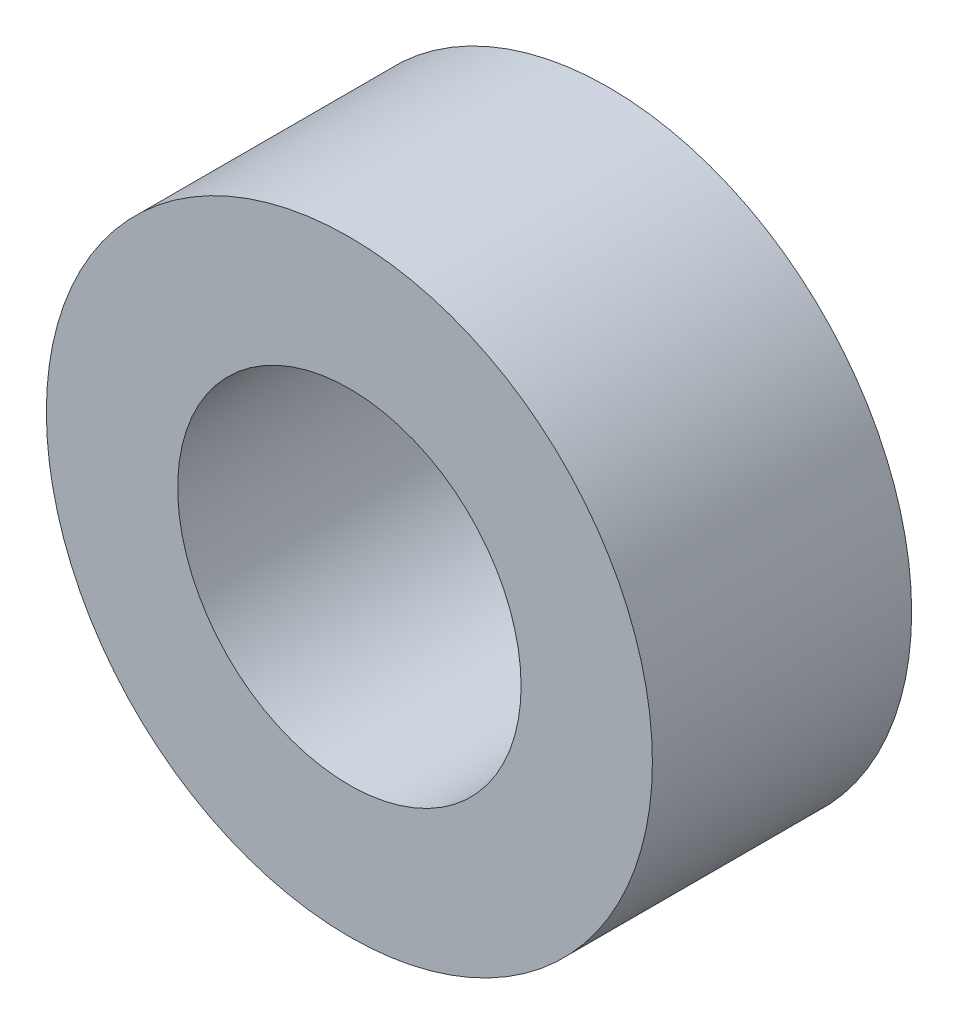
from build123d import *

# Parameters (mm, degrees)
ESQUISSE1_R        = 90
ESQUISSE1_R_2      = 51
BOSS_EXTRU_1_DEPTH = 77


with BuildPart() as part:
    # Esquisse1 → Boss.-Extru.1 (new body)
    with BuildSketch(Plane.XY):
        Circle(ESQUISSE1_R)
        Circle(ESQUISSE1_R_2, mode=Mode.SUBTRACT)
    extrude(amount=BOSS_EXTRU_1_DEPTH)


solid = part.part
